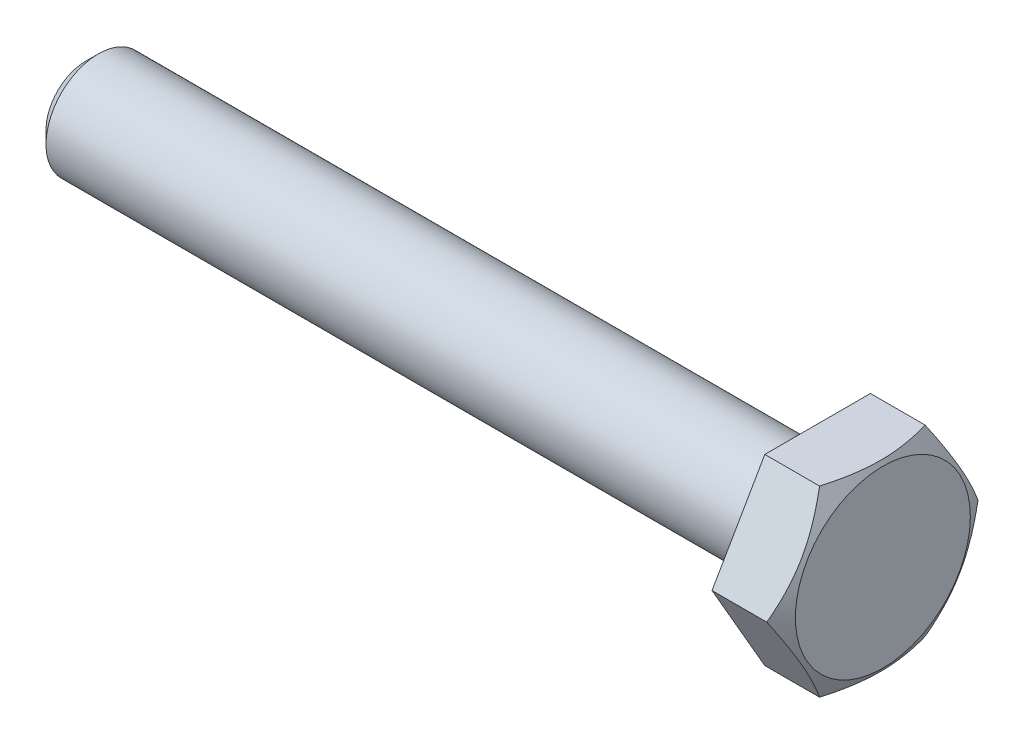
ISO-10303-21;
HEADER;
FILE_DESCRIPTION(('STEP AP214'),'2;1');
FILE_NAME('part.step','',(''),(''),'','','');
FILE_SCHEMA(('AUTOMOTIVE_DESIGN { 1 0 10303 214 1 1 1 1 }'));
ENDSEC;
DATA;
#1=APPLICATION_CONTEXT('core data for automotive mechanical design processes');
#2=APPLICATION_PROTOCOL_DEFINITION('international standard','automotive_design',2000,#1);
#3=PRODUCT_CONTEXT('',#1,'mechanical');
#4=PRODUCT('Part','Part','',(#3));
#5=PRODUCT_RELATED_PRODUCT_CATEGORY('part','',(#4));
#6=PRODUCT_DEFINITION_FORMATION('','',#4);
#7=PRODUCT_DEFINITION_CONTEXT('part definition',#1,'design');
#8=PRODUCT_DEFINITION('design','',#6,#7);
#9=PRODUCT_DEFINITION_SHAPE('','',#8);
#10=(LENGTH_UNIT() NAMED_UNIT(*) SI_UNIT(.MILLI.,.METRE.));
#11=(NAMED_UNIT(*) PLANE_ANGLE_UNIT() SI_UNIT($,.RADIAN.));
#12=(NAMED_UNIT(*) SI_UNIT($,.STERADIAN.) SOLID_ANGLE_UNIT());
#13=UNCERTAINTY_MEASURE_WITH_UNIT(LENGTH_MEASURE(1.E-05),#10,'distance_accuracy_value','');
#14=(GEOMETRIC_REPRESENTATION_CONTEXT(3) GLOBAL_UNCERTAINTY_ASSIGNED_CONTEXT((#13)) GLOBAL_UNIT_ASSIGNED_CONTEXT((#10,
#11,#12)) REPRESENTATION_CONTEXT('',''));
#15=CARTESIAN_POINT('',(0.,0.,0.));
#16=DIRECTION('',(0.,0.,1.));
#17=DIRECTION('',(1.,0.,0.));
#18=AXIS2_PLACEMENT_3D('',#15,#16,#17);
#19=CARTESIAN_POINT('',(44.45,3.17499999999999,0.));
#20=DIRECTION('',(-1.,0.,0.));
#21=DIRECTION('',(0.,0.,1.));
#22=AXIS2_PLACEMENT_3D('',#19,#20,#21);
#23=PLANE('',#22);
#24=CARTESIAN_POINT('',(44.45,0.,0.));
#25=DIRECTION('',(1.,0.,0.));
#26=DIRECTION('',(0.,0.,-1.));
#27=AXIS2_PLACEMENT_3D('',#24,#25,#26);
#28=CIRCLE('',#27,3.17499999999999);
#29=CARTESIAN_POINT('',(44.45,0.,-3.17499999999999));
#30=VERTEX_POINT('',#29);
#31=EDGE_CURVE('E512',#30,#30,#28,.T.);
#32=ORIENTED_EDGE('',*,*,#31,.T.);
#33=EDGE_LOOP('',(#32));
#34=FACE_BOUND('',#33,.T.);
#35=DIRECTION('',(0.,-0.866025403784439,0.5));
#36=VECTOR('',#35,1.);
#37=CARTESIAN_POINT('',(44.45,-0.395876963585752,-6.18494032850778));
#38=LINE('',#37,#36);
#39=CARTESIAN_POINT('',(44.45,0.,-6.41349999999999));
#40=VERTEX_POINT('',#39);
#41=CARTESIAN_POINT('',(44.45,-5.55425392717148,-3.20675));
#42=VERTEX_POINT('',#41);
#43=EDGE_CURVE('E438',#40,#42,#38,.T.);
#44=ORIENTED_EDGE('',*,*,#43,.T.);
#45=DIRECTION('',(0.,0.,1.));
#46=VECTOR('',#45,1.);
#47=CARTESIAN_POINT('',(44.45,-5.55425392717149,0.));
#48=LINE('',#47,#46);
#49=CARTESIAN_POINT('',(44.45,-5.55425392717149,3.20674999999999));
#50=VERTEX_POINT('',#49);
#51=EDGE_CURVE('E12',#42,#50,#48,.T.);
#52=ORIENTED_EDGE('',*,*,#51,.T.);
#53=DIRECTION('',(0.,0.866025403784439,0.5));
#54=VECTOR('',#53,1.);
#55=CARTESIAN_POINT('',(44.45,-0.395876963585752,6.18494032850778));
#56=LINE('',#55,#54);
#57=CARTESIAN_POINT('',(44.45,0.,6.41349999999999));
#58=VERTEX_POINT('',#57);
#59=EDGE_CURVE('E396',#50,#58,#56,.T.);
#60=ORIENTED_EDGE('',*,*,#59,.T.);
#61=DIRECTION('',(0.,0.866025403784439,-0.5));
#62=VECTOR('',#61,1.);
#63=CARTESIAN_POINT('',(44.45,5.15837696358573,3.4353096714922));
#64=LINE('',#63,#62);
#65=CARTESIAN_POINT('',(44.45,5.55425392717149,3.20674999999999));
#66=VERTEX_POINT('',#65);
#67=EDGE_CURVE('E458',#58,#66,#64,.T.);
#68=ORIENTED_EDGE('',*,*,#67,.T.);
#69=DIRECTION('',(0.,0.,-1.));
#70=VECTOR('',#69,1.);
#71=CARTESIAN_POINT('',(44.45,5.55425392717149,0.));
#72=LINE('',#71,#70);
#73=CARTESIAN_POINT('',(44.45,5.55425392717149,-3.20674999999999));
#74=VERTEX_POINT('',#73);
#75=EDGE_CURVE('E456',#66,#74,#72,.T.);
#76=ORIENTED_EDGE('',*,*,#75,.T.);
#77=DIRECTION('',(0.,-0.866025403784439,-0.5));
#78=VECTOR('',#77,1.);
#79=CARTESIAN_POINT('',(44.45,5.15837696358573,-3.4353096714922));
#80=LINE('',#79,#78);
#81=EDGE_CURVE('E442',#74,#40,#80,.T.);
#82=ORIENTED_EDGE('',*,*,#81,.T.);
#83=EDGE_LOOP('',(#44,#52,#60,#68,#76,#82));
#84=FACE_BOUND('',#83,.T.);
#85=ADVANCED_FACE('F387',(#34,#84),#23,.T.);
#86=CARTESIAN_POINT('',(0.,0.,0.));
#87=DIRECTION('',(-1.,0.,0.));
#88=DIRECTION('',(0.,0.,1.));
#89=AXIS2_PLACEMENT_3D('',#86,#87,#88);
#90=PLANE('',#89);
#91=CARTESIAN_POINT('',(0.,0.,0.));
#92=DIRECTION('',(1.,0.,0.));
#93=DIRECTION('',(0.,0.,-1.));
#94=AXIS2_PLACEMENT_3D('',#91,#92,#93);
#95=CIRCLE('',#94,2.41299999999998);
#96=CARTESIAN_POINT('',(0.,0.,-2.41299999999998));
#97=VERTEX_POINT('',#96);
#98=EDGE_CURVE('E524',#97,#97,#95,.T.);
#99=ORIENTED_EDGE('',*,*,#98,.F.);
#100=EDGE_LOOP('',(#99));
#101=FACE_BOUND('',#100,.T.);
#102=ADVANCED_FACE('F556',(#101),#90,.T.);
#103=CARTESIAN_POINT('',(0.762000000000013,0.,0.));
#104=DIRECTION('',(1.,0.,0.));
#105=DIRECTION('',(0.,0.,-1.));
#106=AXIS2_PLACEMENT_3D('',#103,#104,#105);
#107=CONICAL_SURFACE('',#106,3.17499999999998,0.78539816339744);
#108=ORIENTED_EDGE('',*,*,#98,.T.);
#109=EDGE_LOOP('',(#108));
#110=FACE_BOUND('',#109,.T.);
#111=CARTESIAN_POINT('',(0.762000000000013,0.,0.));
#112=DIRECTION('',(1.,0.,0.));
#113=DIRECTION('',(0.,0.,-1.));
#114=AXIS2_PLACEMENT_3D('',#111,#112,#113);
#115=CIRCLE('',#114,3.17499999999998);
#116=CARTESIAN_POINT('',(0.762000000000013,0.,-3.17499999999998));
#117=VERTEX_POINT('',#116);
#118=EDGE_CURVE('E521',#117,#117,#115,.T.);
#119=ORIENTED_EDGE('',*,*,#118,.F.);
#120=EDGE_LOOP('',(#119));
#121=FACE_BOUND('',#120,.T.);
#122=ADVANCED_FACE('F562',(#110,#121),#107,.T.);
#123=CARTESIAN_POINT('',(159.71061789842,0.,0.));
#124=DIRECTION('',(1.,0.,0.));
#125=DIRECTION('',(0.,0.,-1.));
#126=AXIS2_PLACEMENT_3D('',#123,#124,#125);
#127=CYLINDRICAL_SURFACE('',#126,3.17499999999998);
#128=ORIENTED_EDGE('',*,*,#118,.T.);
#129=EDGE_LOOP('',(#128));
#130=FACE_BOUND('',#129,.T.);
#131=ORIENTED_EDGE('',*,*,#31,.F.);
#132=EDGE_LOOP('',(#131));
#133=FACE_BOUND('',#132,.T.);
#134=ADVANCED_FACE('F504',(#130,#133),#127,.T.);
#135=CARTESIAN_POINT('',(41.6052,-5.55425392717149,3.20674999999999));
#136=DIRECTION('',(0.,-1.,0.));
#137=DIRECTION('',(0.,0.,-1.));
#138=AXIS2_PLACEMENT_3D('',#135,#136,#137);
#139=PLANE('',#138);
#140=DIRECTION('',(1.,0.,0.));
#141=VECTOR('',#140,1.);
#142=CARTESIAN_POINT('',(41.6052,-5.55425392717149,3.20674999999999));
#143=LINE('',#142,#141);
#144=CARTESIAN_POINT('',(47.7774,-5.55425392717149,3.20674999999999));
#145=VERTEX_POINT('',#144);
#146=EDGE_CURVE('E468',#50,#145,#143,.T.);
#147=ORIENTED_EDGE('',*,*,#146,.F.);
#148=ORIENTED_EDGE('',*,*,#51,.F.);
#149=DIRECTION('',(1.,0.,0.));
#150=VECTOR('',#149,1.);
#151=CARTESIAN_POINT('',(41.6052,-5.55425392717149,-3.20674999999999));
#152=LINE('',#151,#150);
#153=CARTESIAN_POINT('',(47.7774,-5.55425392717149,-3.20674999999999));
#154=VERTEX_POINT('',#153);
#155=EDGE_CURVE('E408',#42,#154,#152,.T.);
#156=ORIENTED_EDGE('',*,*,#155,.T.);
#157=CARTESIAN_POINT('',(45.6249305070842,-5.55425392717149,-8.48552113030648));
#158=CARTESIAN_POINT('',(45.7426264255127,-5.55425392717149,-8.24180725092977));
#159=CARTESIAN_POINT('',(45.8591464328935,-5.55425392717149,-7.99751496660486));
#160=CARTESIAN_POINT('',(46.0891622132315,-5.55425392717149,-7.5074607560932));
#161=CARTESIAN_POINT('',(46.2026574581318,-5.55425392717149,-7.26169858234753));
#162=CARTESIAN_POINT('',(46.4265534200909,-5.55425392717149,-6.76705461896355));
#163=CARTESIAN_POINT('',(46.5369325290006,-5.55425392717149,-6.51816301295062));
#164=CARTESIAN_POINT('',(46.752921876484,-5.55425392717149,-6.01832699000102));
#165=CARTESIAN_POINT('',(46.8585323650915,-5.55425392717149,-5.76738268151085));
#166=CARTESIAN_POINT('',(47.0649326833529,-5.55425392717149,-5.26001668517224));
#167=CARTESIAN_POINT('',(47.1656500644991,-5.55425392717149,-5.00356536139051));
#168=CARTESIAN_POINT('',(47.3591484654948,-5.55425392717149,-4.48763103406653));
#169=CARTESIAN_POINT('',(47.4519286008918,-5.55425392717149,-4.22814769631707));
#170=CARTESIAN_POINT('',(47.6270454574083,-5.55425392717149,-3.70627593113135));
#171=CARTESIAN_POINT('',(47.7094045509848,-5.55425392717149,-3.44389508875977));
#172=CARTESIAN_POINT('',(47.8609921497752,-5.55425392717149,-2.9154042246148));
#173=CARTESIAN_POINT('',(47.930224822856,-5.55425392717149,-2.64929541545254));
#174=CARTESIAN_POINT('',(48.0521881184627,-5.55425392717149,-2.1131591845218));
#175=CARTESIAN_POINT('',(48.1049133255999,-5.55425392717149,-1.84313050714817));
#176=CARTESIAN_POINT('',(48.1902952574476,-5.55425392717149,-1.29983921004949));
#177=CARTESIAN_POINT('',(48.2229519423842,-5.55425392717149,-1.02657658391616));
#178=CARTESIAN_POINT('',(48.2653073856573,-5.55425392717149,-0.47996384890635));
#179=CARTESIAN_POINT('',(48.2751494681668,-5.55425392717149,-0.206625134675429));
#180=CARTESIAN_POINT('',(48.2713613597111,-5.55425392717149,0.339829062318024));
#181=CARTESIAN_POINT('',(48.2577371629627,-5.55425392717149,0.612944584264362));
#182=CARTESIAN_POINT('',(48.2153436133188,-5.55425392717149,1.07982371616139));
#183=CARTESIAN_POINT('',(48.191971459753,-5.55425392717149,1.27410445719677));
#184=CARTESIAN_POINT('',(48.1348821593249,-5.55425392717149,1.66115155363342));
#185=CARTESIAN_POINT('',(48.1011634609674,-5.55425392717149,1.85391767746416));
#186=CARTESIAN_POINT('',(47.9861662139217,-5.55425392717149,2.43024992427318));
#187=CARTESIAN_POINT('',(47.8911237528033,-5.55425392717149,2.8110952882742));
#188=CARTESIAN_POINT('',(47.7274062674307,-5.55425392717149,3.38074257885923));
#189=CARTESIAN_POINT('',(47.6685135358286,-5.55425392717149,3.57252287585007));
#190=CARTESIAN_POINT('',(47.544895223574,-5.55425392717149,3.95423042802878));
#191=CARTESIAN_POINT('',(47.4801691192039,-5.55425392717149,4.14415751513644));
#192=CARTESIAN_POINT('',(47.3462682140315,-5.55425392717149,4.52121083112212));
#193=CARTESIAN_POINT('',(47.2771206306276,-5.55425392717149,4.70834682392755));
#194=CARTESIAN_POINT('',(47.1348460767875,-5.55425392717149,5.08102887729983));
#195=CARTESIAN_POINT('',(47.0617204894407,-5.55425392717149,5.26657546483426));
#196=CARTESIAN_POINT('',(46.9869788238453,-5.55425392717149,5.45145321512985));
#197=B_SPLINE_CURVE_WITH_KNOTS('',3,(#157,#158,#159,#160,#161,#162,#163,#164,#165,#166,#167,
#168,#169,#170,#171,#172,#173,#174,#175,#176,#177,#178,#179,#180,#181,#182,#183,#184,#185,#186,
#187,#188,#189,#190,#191,#192,#193,#194,#195,#196),.UNSPECIFIED.,.F.,.F.,(4,2,2,2,2,2,2,2,2,2,2,
2,2,2,2,2,2,2,2,4),(0.,0.811946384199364,1.62403359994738,2.44080178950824,3.2575271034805,
4.08398560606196,4.91053608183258,5.73528082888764,6.55976326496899,7.38451589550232,
8.20927016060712,9.0288290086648,9.8481785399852,10.4349365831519,11.0217826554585,
12.1977403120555,12.7995507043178,13.4014151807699,13.9998772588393,14.5981325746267),.UNSPECIFIED.);
#198=EDGE_CURVE('E475',#145,#154,#197,.F.);
#199=ORIENTED_EDGE('',*,*,#198,.F.);
#200=EDGE_LOOP('',(#147,#148,#156,#199));
#201=FACE_BOUND('',#200,.T.);
#202=ADVANCED_FACE('F473',(#201),#139,.T.);
#203=CARTESIAN_POINT('',(41.6052,0.,6.41349999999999));
#204=DIRECTION('',(0.,-0.5,0.866025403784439));
#205=DIRECTION('',(0.,-0.866025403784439,-0.5));
#206=AXIS2_PLACEMENT_3D('',#203,#204,#205);
#207=PLANE('',#206);
#208=DIRECTION('',(1.,0.,0.));
#209=VECTOR('',#208,1.);
#210=CARTESIAN_POINT('',(41.6052,0.,6.41349999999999));
#211=LINE('',#210,#209);
#212=CARTESIAN_POINT('',(47.7774,0.,6.41349999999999));
#213=VERTEX_POINT('',#212);
#214=EDGE_CURVE('E471',#58,#213,#211,.T.);
#215=ORIENTED_EDGE('',*,*,#214,.F.);
#216=ORIENTED_EDGE('',*,*,#59,.F.);
#217=ORIENTED_EDGE('',*,*,#146,.T.);
#218=CARTESIAN_POINT('',(47.7773333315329,0.000200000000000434,6.41361547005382));
#219=CARTESIAN_POINT('',(47.81802405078,-0.121889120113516,6.34312728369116));
#220=CARTESIAN_POINT('',(47.8568681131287,-0.244433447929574,6.2723762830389));
#221=CARTESIAN_POINT('',(47.9303543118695,-0.490517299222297,6.13029970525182));
#222=CARTESIAN_POINT('',(47.9649946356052,-0.614057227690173,6.05897389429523));
#223=CARTESIAN_POINT('',(48.0619300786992,-0.986655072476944,5.84385442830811));
#224=CARTESIAN_POINT('',(48.117066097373,-1.23718376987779,5.69921161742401));
#225=CARTESIAN_POINT('',(48.1817200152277,-1.61209541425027,5.48275627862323));
#226=CARTESIAN_POINT('',(48.2001381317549,-1.73535814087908,5.41159051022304));
#227=CARTESIAN_POINT('',(48.2310228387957,-1.98244057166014,5.26893740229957));
#228=CARTESIAN_POINT('',(48.2434899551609,-2.10626022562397,5.19745009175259));
#229=CARTESIAN_POINT('',(48.2621549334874,-2.35411459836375,5.05435130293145));
#230=CARTESIAN_POINT('',(48.2683599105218,-2.47814891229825,4.98274005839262));
#231=CARTESIAN_POINT('',(48.2743742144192,-2.72632528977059,4.83945536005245));
#232=CARTESIAN_POINT('',(48.2741837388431,-2.85046734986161,4.76778190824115));
#233=CARTESIAN_POINT('',(48.2648708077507,-3.1905808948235,4.57141726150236));
#234=CARTESIAN_POINT('',(48.2492350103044,-3.40644106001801,4.44679033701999));
#235=CARTESIAN_POINT('',(48.199652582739,-3.83672765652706,4.19836425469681));
#236=CARTESIAN_POINT('',(48.1656890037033,-4.05115257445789,4.07456597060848));
#237=CARTESIAN_POINT('',(48.0807894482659,-4.48230520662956,3.82563988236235));
#238=CARTESIAN_POINT('',(48.0294937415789,-4.69897851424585,3.70054348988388));
#239=CARTESIAN_POINT('',(47.9130730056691,-5.12909381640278,3.452216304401));
#240=CARTESIAN_POINT('',(47.8479753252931,-5.34254131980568,3.32898233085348));
#241=CARTESIAN_POINT('',(47.7773333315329,-5.55445392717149,3.20663452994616));
#242=B_SPLINE_CURVE_WITH_KNOTS('',3,(#218,#219,#220,#221,#222,#223,#224,#225,#226,#227,#228,
#229,#230,#231,#232,#233,#234,#235,#236,#237,#238,#239,#240,#241),.UNSPECIFIED.,.F.,.F.,(4,2,2,
2,2,2,2,2,2,2,2,4),(0.,0.440158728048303,0.880506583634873,1.76303214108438,2.19348644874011,
2.62390271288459,3.05382938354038,3.48374277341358,4.23218874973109,4.98132805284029,
5.74708282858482,6.51133419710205),.UNSPECIFIED.);
#243=EDGE_CURVE('E513',#213,#145,#242,.T.);
#244=ORIENTED_EDGE('',*,*,#243,.F.);
#245=EDGE_LOOP('',(#215,#216,#217,#244));
#246=FACE_BOUND('',#245,.T.);
#247=ADVANCED_FACE('F467',(#246),#207,.T.);
#248=CARTESIAN_POINT('',(41.6052,5.55425392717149,3.20674999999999));
#249=DIRECTION('',(0.,0.5,0.866025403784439));
#250=DIRECTION('',(0.,-0.866025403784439,0.5));
#251=AXIS2_PLACEMENT_3D('',#248,#249,#250);
#252=PLANE('',#251);
#253=DIRECTION('',(1.,0.,0.));
#254=VECTOR('',#253,1.);
#255=CARTESIAN_POINT('',(41.6052,5.55425392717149,3.20674999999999));
#256=LINE('',#255,#254);
#257=CARTESIAN_POINT('',(47.7774,5.55425392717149,3.20674999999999));
#258=VERTEX_POINT('',#257);
#259=EDGE_CURVE('E479',#66,#258,#256,.T.);
#260=ORIENTED_EDGE('',*,*,#259,.F.);
#261=ORIENTED_EDGE('',*,*,#67,.F.);
#262=ORIENTED_EDGE('',*,*,#214,.T.);
#263=CARTESIAN_POINT('',(47.7773333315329,5.55445392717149,3.20663452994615));
#264=CARTESIAN_POINT('',(47.81802405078,5.43236480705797,3.27712271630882));
#265=CARTESIAN_POINT('',(47.8568681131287,5.30982047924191,3.34787371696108));
#266=CARTESIAN_POINT('',(47.9303543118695,5.06373662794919,3.48995029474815));
#267=CARTESIAN_POINT('',(47.9649946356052,4.94019669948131,3.56127610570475));
#268=CARTESIAN_POINT('',(48.0619300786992,4.56759885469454,3.77639557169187));
#269=CARTESIAN_POINT('',(48.117066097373,4.3170701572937,3.92103838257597));
#270=CARTESIAN_POINT('',(48.1817200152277,3.94215851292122,4.13749372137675));
#271=CARTESIAN_POINT('',(48.2001381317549,3.81889578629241,4.20865948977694));
#272=CARTESIAN_POINT('',(48.2310228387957,3.57181335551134,4.35131259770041));
#273=CARTESIAN_POINT('',(48.2434899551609,3.44799370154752,4.42279990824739));
#274=CARTESIAN_POINT('',(48.2621549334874,3.20013932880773,4.56589869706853));
#275=CARTESIAN_POINT('',(48.2683599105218,3.07610501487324,4.63750994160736));
#276=CARTESIAN_POINT('',(48.2743742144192,2.8279286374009,4.78079463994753));
#277=CARTESIAN_POINT('',(48.2741837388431,2.70378657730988,4.85246809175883));
#278=CARTESIAN_POINT('',(48.2648708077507,2.36367303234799,5.04883273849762));
#279=CARTESIAN_POINT('',(48.2492350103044,2.14781286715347,5.17345966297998));
#280=CARTESIAN_POINT('',(48.199652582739,1.71752627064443,5.42188574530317));
#281=CARTESIAN_POINT('',(48.1656890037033,1.5031013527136,5.5456840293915));
#282=CARTESIAN_POINT('',(48.0807894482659,1.07194872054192,5.79461011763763));
#283=CARTESIAN_POINT('',(48.0294937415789,0.855275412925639,5.9197065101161));
#284=CARTESIAN_POINT('',(47.9130730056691,0.42516011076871,6.16803369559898));
#285=CARTESIAN_POINT('',(47.8479753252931,0.211712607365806,6.2912676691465));
#286=CARTESIAN_POINT('',(47.7773333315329,-0.000199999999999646,6.41361547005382));
#287=B_SPLINE_CURVE_WITH_KNOTS('',3,(#263,#264,#265,#266,#267,#268,#269,#270,#271,#272,#273,
#274,#275,#276,#277,#278,#279,#280,#281,#282,#283,#284,#285,#286),.UNSPECIFIED.,.F.,.F.,(4,2,2,
2,2,2,2,2,2,2,2,4),(0.,0.440158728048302,0.880506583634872,1.76303214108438,2.19348644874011,
2.62390271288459,3.05382938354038,3.48374277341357,4.23218874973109,4.98132805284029,
5.74708282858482,6.51133419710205),.UNSPECIFIED.);
#288=EDGE_CURVE('E534',#258,#213,#287,.T.);
#289=ORIENTED_EDGE('',*,*,#288,.F.);
#290=EDGE_LOOP('',(#260,#261,#262,#289));
#291=FACE_BOUND('',#290,.T.);
#292=ADVANCED_FACE('F543',(#291),#252,.T.);
#293=CARTESIAN_POINT('',(41.6052,5.55425392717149,-3.20674999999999));
#294=DIRECTION('',(0.,1.,0.));
#295=DIRECTION('',(0.,0.,1.));
#296=AXIS2_PLACEMENT_3D('',#293,#294,#295);
#297=PLANE('',#296);
#298=DIRECTION('',(1.,0.,0.));
#299=VECTOR('',#298,1.);
#300=CARTESIAN_POINT('',(41.6052,5.55425392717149,-3.20674999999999));
#301=LINE('',#300,#299);
#302=CARTESIAN_POINT('',(47.7774,5.55425392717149,-3.20674999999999));
#303=VERTEX_POINT('',#302);
#304=EDGE_CURVE('E452',#74,#303,#301,.T.);
#305=ORIENTED_EDGE('',*,*,#304,.F.);
#306=ORIENTED_EDGE('',*,*,#75,.F.);
#307=ORIENTED_EDGE('',*,*,#259,.T.);
#308=CARTESIAN_POINT('',(45.6249305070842,5.55425392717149,-8.48552113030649));
#309=CARTESIAN_POINT('',(45.7426264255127,5.55425392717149,-8.24180725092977));
#310=CARTESIAN_POINT('',(45.8591464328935,5.55425392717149,-7.99751496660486));
#311=CARTESIAN_POINT('',(46.0891622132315,5.55425392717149,-7.50746075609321));
#312=CARTESIAN_POINT('',(46.2026574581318,5.55425392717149,-7.26169858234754));
#313=CARTESIAN_POINT('',(46.4265534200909,5.55425392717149,-6.76705461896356));
#314=CARTESIAN_POINT('',(46.5369325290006,5.55425392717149,-6.51816301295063));
#315=CARTESIAN_POINT('',(46.752921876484,5.55425392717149,-6.01832699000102));
#316=CARTESIAN_POINT('',(46.8585323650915,5.55425392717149,-5.76738268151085));
#317=CARTESIAN_POINT('',(47.0649326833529,5.55425392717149,-5.26001668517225));
#318=CARTESIAN_POINT('',(47.1656500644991,5.55425392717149,-5.00356536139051));
#319=CARTESIAN_POINT('',(47.3591484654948,5.55425392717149,-4.48763103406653));
#320=CARTESIAN_POINT('',(47.4519286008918,5.55425392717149,-4.22814769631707));
#321=CARTESIAN_POINT('',(47.6270454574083,5.55425392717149,-3.70627593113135));
#322=CARTESIAN_POINT('',(47.7094045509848,5.55425392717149,-3.44389508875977));
#323=CARTESIAN_POINT('',(47.8609921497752,5.55425392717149,-2.91540422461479));
#324=CARTESIAN_POINT('',(47.930224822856,5.55425392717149,-2.64929541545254));
#325=CARTESIAN_POINT('',(48.0521881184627,5.55425392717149,-2.1131591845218));
#326=CARTESIAN_POINT('',(48.1049133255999,5.55425392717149,-1.84313050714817));
#327=CARTESIAN_POINT('',(48.1902952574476,5.55425392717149,-1.29983921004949));
#328=CARTESIAN_POINT('',(48.2229519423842,5.55425392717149,-1.02657658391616));
#329=CARTESIAN_POINT('',(48.2653073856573,5.55425392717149,-0.47996384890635));
#330=CARTESIAN_POINT('',(48.2751494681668,5.55425392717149,-0.20662513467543));
#331=CARTESIAN_POINT('',(48.2713613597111,5.55425392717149,0.339829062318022));
#332=CARTESIAN_POINT('',(48.2577371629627,5.55425392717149,0.61294458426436));
#333=CARTESIAN_POINT('',(48.2153436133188,5.55425392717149,1.07982371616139));
#334=CARTESIAN_POINT('',(48.191971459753,5.55425392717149,1.27410445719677));
#335=CARTESIAN_POINT('',(48.1348821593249,5.55425392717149,1.66115155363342));
#336=CARTESIAN_POINT('',(48.1011634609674,5.55425392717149,1.85391767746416));
#337=CARTESIAN_POINT('',(47.9861662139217,5.55425392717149,2.43024992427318));
#338=CARTESIAN_POINT('',(47.8911237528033,5.55425392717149,2.8110952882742));
#339=CARTESIAN_POINT('',(47.7274062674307,5.55425392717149,3.38074257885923));
#340=CARTESIAN_POINT('',(47.6685135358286,5.55425392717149,3.57252287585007));
#341=CARTESIAN_POINT('',(47.544895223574,5.55425392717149,3.95423042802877));
#342=CARTESIAN_POINT('',(47.4801691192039,5.55425392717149,4.14415751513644));
#343=CARTESIAN_POINT('',(47.3462682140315,5.55425392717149,4.52121083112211));
#344=CARTESIAN_POINT('',(47.2771206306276,5.55425392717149,4.70834682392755));
#345=CARTESIAN_POINT('',(47.1348460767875,5.55425392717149,5.08102887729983));
#346=CARTESIAN_POINT('',(47.0617204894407,5.55425392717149,5.26657546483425));
#347=CARTESIAN_POINT('',(46.9869788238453,5.55425392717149,5.45145321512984));
#348=B_SPLINE_CURVE_WITH_KNOTS('',3,(#308,#309,#310,#311,#312,#313,#314,#315,#316,#317,#318,
#319,#320,#321,#322,#323,#324,#325,#326,#327,#328,#329,#330,#331,#332,#333,#334,#335,#336,#337,
#338,#339,#340,#341,#342,#343,#344,#345,#346,#347),.UNSPECIFIED.,.F.,.F.,(4,2,2,2,2,2,2,2,2,2,2,
2,2,2,2,2,2,2,2,4),(0.,0.811946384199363,1.62403359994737,2.44080178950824,3.2575271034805,
4.08398560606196,4.91053608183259,5.73528082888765,6.559763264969,7.38451589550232,
8.20927016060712,9.02882900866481,9.8481785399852,10.4349365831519,11.0217826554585,
12.1977403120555,12.7995507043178,13.4014151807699,13.9998772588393,14.5981325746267),.UNSPECIFIED.);
#349=EDGE_CURVE('E535',#303,#258,#348,.T.);
#350=ORIENTED_EDGE('',*,*,#349,.F.);
#351=EDGE_LOOP('',(#305,#306,#307,#350));
#352=FACE_BOUND('',#351,.T.);
#353=ADVANCED_FACE('F546',(#352),#297,.T.);
#354=CARTESIAN_POINT('',(41.6052,0.,-6.41349999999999));
#355=DIRECTION('',(0.,0.5,-0.866025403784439));
#356=DIRECTION('',(0.,0.866025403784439,0.5));
#357=AXIS2_PLACEMENT_3D('',#354,#355,#356);
#358=PLANE('',#357);
#359=DIRECTION('',(1.,0.,0.));
#360=VECTOR('',#359,1.);
#361=CARTESIAN_POINT('',(41.6052,0.,-6.41349999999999));
#362=LINE('',#361,#360);
#363=CARTESIAN_POINT('',(47.7774,0.,-6.41349999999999));
#364=VERTEX_POINT('',#363);
#365=EDGE_CURVE('E403',#40,#364,#362,.T.);
#366=ORIENTED_EDGE('',*,*,#365,.F.);
#367=ORIENTED_EDGE('',*,*,#81,.F.);
#368=ORIENTED_EDGE('',*,*,#304,.T.);
#369=CARTESIAN_POINT('',(47.7773333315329,-0.0002,-6.41361547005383));
#370=CARTESIAN_POINT('',(47.81802405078,0.121889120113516,-6.34312728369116));
#371=CARTESIAN_POINT('',(47.8568681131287,0.244433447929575,-6.2723762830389));
#372=CARTESIAN_POINT('',(47.9303543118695,0.490517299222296,-6.13029970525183));
#373=CARTESIAN_POINT('',(47.9649946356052,0.614057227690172,-6.05897389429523));
#374=CARTESIAN_POINT('',(48.0619300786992,0.986655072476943,-5.84385442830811));
#375=CARTESIAN_POINT('',(48.117066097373,1.23718376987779,-5.69921161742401));
#376=CARTESIAN_POINT('',(48.1817200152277,1.61209541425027,-5.48275627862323));
#377=CARTESIAN_POINT('',(48.2001381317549,1.73535814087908,-5.41159051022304));
#378=CARTESIAN_POINT('',(48.2310228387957,1.98244057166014,-5.26893740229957));
#379=CARTESIAN_POINT('',(48.2434899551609,2.10626022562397,-5.19745009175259));
#380=CARTESIAN_POINT('',(48.2621549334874,2.35411459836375,-5.05435130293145));
#381=CARTESIAN_POINT('',(48.2683599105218,2.47814891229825,-4.98274005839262));
#382=CARTESIAN_POINT('',(48.2743742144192,2.72632528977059,-4.83945536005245));
#383=CARTESIAN_POINT('',(48.2741837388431,2.85046734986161,-4.76778190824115));
#384=CARTESIAN_POINT('',(48.2648708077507,3.1905808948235,-4.57141726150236));
#385=CARTESIAN_POINT('',(48.2492350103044,3.40644106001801,-4.44679033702));
#386=CARTESIAN_POINT('',(48.199652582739,3.83672765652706,-4.19836425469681));
#387=CARTESIAN_POINT('',(48.1656890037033,4.05115257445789,-4.07456597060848));
#388=CARTESIAN_POINT('',(48.0807894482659,4.48230520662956,-3.82563988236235));
#389=CARTESIAN_POINT('',(48.0294937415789,4.69897851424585,-3.70054348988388));
#390=CARTESIAN_POINT('',(47.9130730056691,5.12909381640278,-3.452216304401));
#391=CARTESIAN_POINT('',(47.8479753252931,5.34254131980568,-3.32898233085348));
#392=CARTESIAN_POINT('',(47.7773333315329,5.55445392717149,-3.20663452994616));
#393=B_SPLINE_CURVE_WITH_KNOTS('',3,(#369,#370,#371,#372,#373,#374,#375,#376,#377,#378,#379,
#380,#381,#382,#383,#384,#385,#386,#387,#388,#389,#390,#391,#392),.UNSPECIFIED.,.F.,.F.,(4,2,2,
2,2,2,2,2,2,2,2,4),(0.,0.440158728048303,0.88050658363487,1.76303214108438,2.19348644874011,
2.62390271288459,3.05382938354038,3.48374277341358,4.23218874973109,4.98132805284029,
5.74708282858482,6.51133419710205),.UNSPECIFIED.);
#394=EDGE_CURVE('E450',#364,#303,#393,.T.);
#395=ORIENTED_EDGE('',*,*,#394,.F.);
#396=EDGE_LOOP('',(#366,#367,#368,#395));
#397=FACE_BOUND('',#396,.T.);
#398=ADVANCED_FACE('F446',(#397),#358,.T.);
#399=CARTESIAN_POINT('',(41.6052,-5.55425392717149,-3.20674999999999));
#400=DIRECTION('',(0.,-0.5,-0.866025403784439));
#401=DIRECTION('',(0.,0.866025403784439,-0.5));
#402=AXIS2_PLACEMENT_3D('',#399,#400,#401);
#403=PLANE('',#402);
#404=ORIENTED_EDGE('',*,*,#155,.F.);
#405=ORIENTED_EDGE('',*,*,#43,.F.);
#406=ORIENTED_EDGE('',*,*,#365,.T.);
#407=CARTESIAN_POINT('',(47.7773333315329,-5.55445392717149,-3.20663452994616));
#408=CARTESIAN_POINT('',(47.81802405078,-5.43236480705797,-3.27712271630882));
#409=CARTESIAN_POINT('',(47.8568681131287,-5.30982047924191,-3.34787371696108));
#410=CARTESIAN_POINT('',(47.9303543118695,-5.06373662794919,-3.48995029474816));
#411=CARTESIAN_POINT('',(47.9649946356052,-4.94019669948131,-3.56127610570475));
#412=CARTESIAN_POINT('',(48.0619300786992,-4.56759885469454,-3.77639557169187));
#413=CARTESIAN_POINT('',(48.117066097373,-4.3170701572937,-3.92103838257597));
#414=CARTESIAN_POINT('',(48.1817200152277,-3.94215851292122,-4.13749372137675));
#415=CARTESIAN_POINT('',(48.2001381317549,-3.81889578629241,-4.20865948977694));
#416=CARTESIAN_POINT('',(48.2310228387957,-3.57181335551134,-4.35131259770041));
#417=CARTESIAN_POINT('',(48.2434899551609,-3.44799370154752,-4.42279990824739));
#418=CARTESIAN_POINT('',(48.2621549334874,-3.20013932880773,-4.56589869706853));
#419=CARTESIAN_POINT('',(48.2683599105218,-3.07610501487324,-4.63750994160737));
#420=CARTESIAN_POINT('',(48.2743742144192,-2.8279286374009,-4.78079463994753));
#421=CARTESIAN_POINT('',(48.2741837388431,-2.70378657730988,-4.85246809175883));
#422=CARTESIAN_POINT('',(48.2648708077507,-2.36367303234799,-5.04883273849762));
#423=CARTESIAN_POINT('',(48.2492350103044,-2.14781286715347,-5.17345966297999));
#424=CARTESIAN_POINT('',(48.199652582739,-1.71752627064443,-5.42188574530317));
#425=CARTESIAN_POINT('',(48.1656890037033,-1.5031013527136,-5.5456840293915));
#426=CARTESIAN_POINT('',(48.0807894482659,-1.07194872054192,-5.79461011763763));
#427=CARTESIAN_POINT('',(48.0294937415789,-0.855275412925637,-5.9197065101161));
#428=CARTESIAN_POINT('',(47.9130730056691,-0.425160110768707,-6.16803369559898));
#429=CARTESIAN_POINT('',(47.8479753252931,-0.211712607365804,-6.2912676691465));
#430=CARTESIAN_POINT('',(47.7773333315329,0.000200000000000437,-6.41361547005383));
#431=B_SPLINE_CURVE_WITH_KNOTS('',3,(#407,#408,#409,#410,#411,#412,#413,#414,#415,#416,#417,
#418,#419,#420,#421,#422,#423,#424,#425,#426,#427,#428,#429,#430),.UNSPECIFIED.,.F.,.F.,(4,2,2,
2,2,2,2,2,2,2,2,4),(0.,0.440158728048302,0.880506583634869,1.76303214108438,2.19348644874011,
2.62390271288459,3.05382938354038,3.48374277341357,4.23218874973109,4.98132805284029,
5.74708282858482,6.51133419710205),.UNSPECIFIED.);
#432=EDGE_CURVE('E476',#154,#364,#431,.T.);
#433=ORIENTED_EDGE('',*,*,#432,.F.);
#434=EDGE_LOOP('',(#404,#405,#406,#433));
#435=FACE_BOUND('',#434,.T.);
#436=ADVANCED_FACE('F439',(#435),#403,.T.);
#437=CARTESIAN_POINT('',(48.4124,0.,0.));
#438=DIRECTION('',(1.,0.,0.));
#439=DIRECTION('',(0.,0.,-1.));
#440=AXIS2_PLACEMENT_3D('',#437,#438,#439);
#441=PLANE('',#440);
#442=CARTESIAN_POINT('',(48.4124,0.,0.));
#443=DIRECTION('',(1.,0.,0.));
#444=DIRECTION('',(0.,0.,-1.));
#445=AXIS2_PLACEMENT_3D('',#442,#443,#444);
#446=CIRCLE('',#445,5.31364773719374);
#447=CARTESIAN_POINT('',(48.4124,0.,-5.31364773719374));
#448=VERTEX_POINT('',#447);
#449=EDGE_CURVE('E443',#448,#448,#446,.T.);
#450=ORIENTED_EDGE('',*,*,#449,.T.);
#451=EDGE_LOOP('',(#450));
#452=FACE_BOUND('',#451,.T.);
#453=ADVANCED_FACE('F498',(#452),#441,.T.);
#454=CARTESIAN_POINT('',(48.4124,0.,0.));
#455=DIRECTION('',(-1.,0.,0.));
#456=DIRECTION('',(0.,0.,1.));
#457=AXIS2_PLACEMENT_3D('',#454,#455,#456);
#458=CONICAL_SURFACE('',#457,5.31364773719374,1.0471975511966);
#459=ORIENTED_EDGE('',*,*,#449,.F.);
#460=EDGE_LOOP('',(#459));
#461=FACE_BOUND('',#460,.T.);
#462=ORIENTED_EDGE('',*,*,#243,.T.);
#463=ORIENTED_EDGE('',*,*,#198,.T.);
#464=ORIENTED_EDGE('',*,*,#432,.T.);
#465=ORIENTED_EDGE('',*,*,#394,.T.);
#466=ORIENTED_EDGE('',*,*,#349,.T.);
#467=ORIENTED_EDGE('',*,*,#288,.T.);
#468=EDGE_LOOP('',(#462,#463,#464,#465,#466,#467));
#469=FACE_BOUND('',#468,.T.);
#470=ADVANCED_FACE('F389',(#461,#469),#458,.T.);
#471=CLOSED_SHELL('',(#85,#102,#122,#134,#202,#247,#292,#353,#398,#436,#453,#470));
#472=MANIFOLD_SOLID_BREP('B2',#471);
#473=ADVANCED_BREP_SHAPE_REPRESENTATION('',(#18,#472),#14);
#474=SHAPE_DEFINITION_REPRESENTATION(#9,#473);
ENDSEC;
END-ISO-10303-21;
